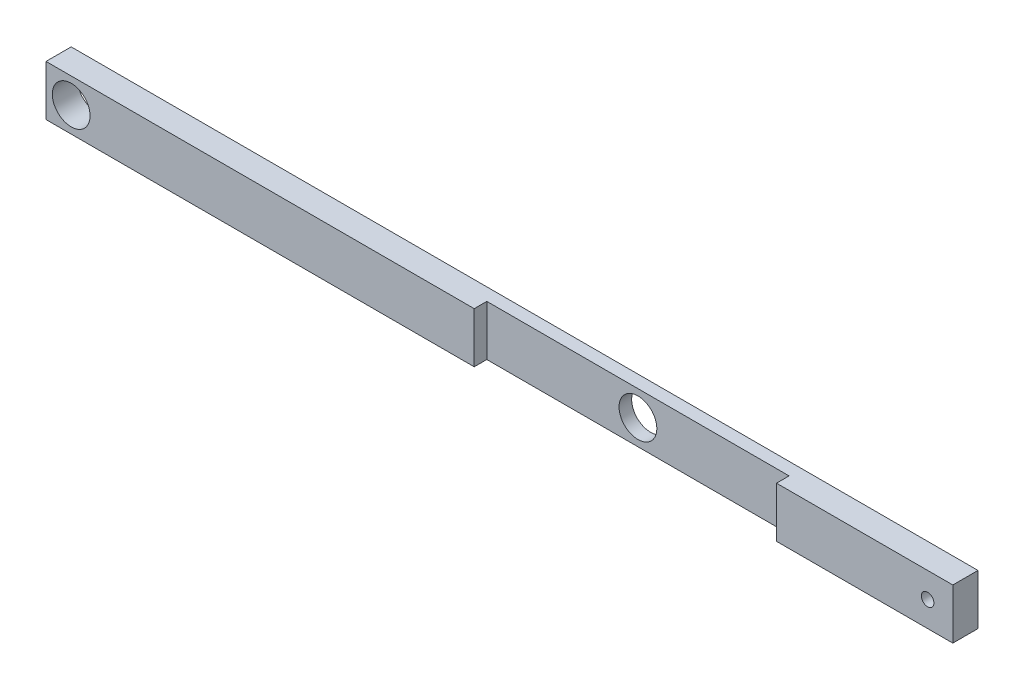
from build123d import *

# Parameters (mm, degrees)
SKETCH_1_W          = 360
SKETCH_1_H          = 20
EXTRUDE_1_DEPTH     = 10
SKETCH_2_R          = 7.5
CUT_EXTRUDE_2_DEPTH = 361.693775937
SKETCH_3_R          = 7.5
CUT_EXTRUDE_3_DEPTH = 361.693775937
SKETCH_4_R          = 2.5
CUT_EXTRUDE_4_DEPTH = 361.693775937
SKETCH_5_W          = 120
SKETCH_5_H          = 20
CUT_EXTRUDE_5_DEPTH = 5


with BuildPart() as part:
    # Sketch 1 → Extrude 1 (new body)
    with BuildSketch(Plane.XY):
        with Locations((180, 10)):
            Rectangle(SKETCH_1_W, SKETCH_1_H)
    extrude(amount=EXTRUDE_1_DEPTH)

    # Sketch 2 → Cut-Extrude 2 (cut, through all)
    with BuildSketch(Plane.XY.offset(10)):
        with Locations((10, 10)):
            Circle(SKETCH_2_R)
    extrude(amount=-CUT_EXTRUDE_2_DEPTH, mode=Mode.SUBTRACT)

    # Sketch 3 → Cut-Extrude 3 (cut, through all)
    with BuildSketch(Plane.XY.offset(10)):
        with Locations((230, 10)):
            Circle(SKETCH_3_R)
    extrude(amount=-CUT_EXTRUDE_3_DEPTH, mode=Mode.SUBTRACT)

    # Sketch 4 → Cut-Extrude 4 (cut, through all)
    with BuildSketch(Plane.XY.offset(10)):
        with Locations((350, 10)):
            Circle(SKETCH_4_R)
    extrude(amount=-CUT_EXTRUDE_4_DEPTH, mode=Mode.SUBTRACT)

    # Sketch 5 → Cut-Extrude 5 (cut)
    with BuildSketch(Plane.XY.offset(10)):
        with Locations((230, 10)):
            Rectangle(SKETCH_5_W, SKETCH_5_H)
    extrude(amount=-CUT_EXTRUDE_5_DEPTH, mode=Mode.SUBTRACT)


solid = part.part
